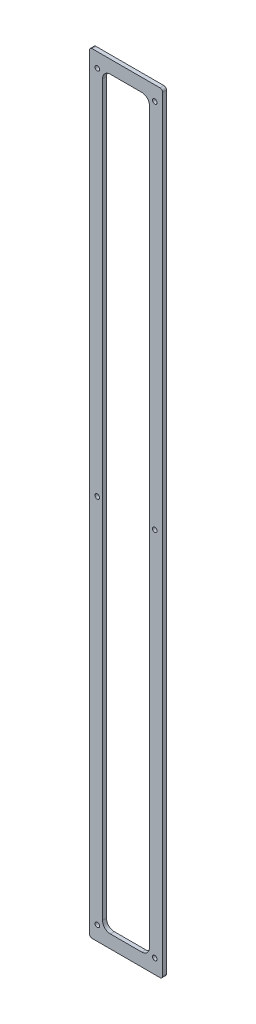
ISO-10303-21;
HEADER;
FILE_DESCRIPTION(('STEP AP214'),'2;1');
FILE_NAME('part.step','',(''),(''),'','','');
FILE_SCHEMA(('AUTOMOTIVE_DESIGN { 1 0 10303 214 1 1 1 1 }'));
ENDSEC;
DATA;
#1=APPLICATION_CONTEXT('core data for automotive mechanical design processes');
#2=APPLICATION_PROTOCOL_DEFINITION('international standard','automotive_design',2000,#1);
#3=PRODUCT_CONTEXT('',#1,'mechanical');
#4=PRODUCT('Part','Part','',(#3));
#5=PRODUCT_RELATED_PRODUCT_CATEGORY('part','',(#4));
#6=PRODUCT_DEFINITION_FORMATION('','',#4);
#7=PRODUCT_DEFINITION_CONTEXT('part definition',#1,'design');
#8=PRODUCT_DEFINITION('design','',#6,#7);
#9=PRODUCT_DEFINITION_SHAPE('','',#8);
#10=(LENGTH_UNIT() NAMED_UNIT(*) SI_UNIT(.MILLI.,.METRE.));
#11=(NAMED_UNIT(*) PLANE_ANGLE_UNIT() SI_UNIT($,.RADIAN.));
#12=(NAMED_UNIT(*) SI_UNIT($,.STERADIAN.) SOLID_ANGLE_UNIT());
#13=UNCERTAINTY_MEASURE_WITH_UNIT(LENGTH_MEASURE(1.E-05),#10,'distance_accuracy_value','');
#14=(GEOMETRIC_REPRESENTATION_CONTEXT(3) GLOBAL_UNCERTAINTY_ASSIGNED_CONTEXT((#13)) GLOBAL_UNIT_ASSIGNED_CONTEXT((#10,
#11,#12)) REPRESENTATION_CONTEXT('',''));
#15=CARTESIAN_POINT('',(0.,0.,0.));
#16=DIRECTION('',(0.,0.,1.));
#17=DIRECTION('',(1.,0.,0.));
#18=AXIS2_PLACEMENT_3D('',#15,#16,#17);
#19=CARTESIAN_POINT('',(-44.4440386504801,468.376,4.7752));
#20=DIRECTION('',(1.,0.,0.));
#21=DIRECTION('',(0.,1.,0.));
#22=AXIS2_PLACEMENT_3D('',#19,#20,#21);
#23=PLANE('',#22);
#24=DIRECTION('',(0.,-1.,0.));
#25=VECTOR('',#24,1.);
#26=CARTESIAN_POINT('',(-44.4440386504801,468.376,0.));
#27=LINE('',#26,#25);
#28=CARTESIAN_POINT('',(-44.4440386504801,465.201,0.));
#29=VERTEX_POINT('',#28);
#30=CARTESIAN_POINT('',(-44.4440386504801,-465.201,0.));
#31=VERTEX_POINT('',#30);
#32=EDGE_CURVE('E179',#29,#31,#27,.T.);
#33=ORIENTED_EDGE('',*,*,#32,.T.);
#34=DIRECTION('',(0.,0.,-1.));
#35=VECTOR('',#34,1.);
#36=CARTESIAN_POINT('',(-44.4440386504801,-465.201,4.7752));
#37=LINE('',#36,#35);
#38=CARTESIAN_POINT('',(-44.4440386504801,-465.201,4.7752));
#39=VERTEX_POINT('',#38);
#40=EDGE_CURVE('E203',#31,#39,#37,.F.);
#41=ORIENTED_EDGE('',*,*,#40,.T.);
#42=DIRECTION('',(0.,-1.,0.));
#43=VECTOR('',#42,1.);
#44=CARTESIAN_POINT('',(-44.4440386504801,468.376,4.7752));
#45=LINE('',#44,#43);
#46=CARTESIAN_POINT('',(-44.4440386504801,465.201,4.7752));
#47=VERTEX_POINT('',#46);
#48=EDGE_CURVE('E177',#47,#39,#45,.T.);
#49=ORIENTED_EDGE('',*,*,#48,.F.);
#50=DIRECTION('',(0.,0.,-1.));
#51=VECTOR('',#50,1.);
#52=CARTESIAN_POINT('',(-44.4440386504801,465.201,4.7752));
#53=LINE('',#52,#51);
#54=EDGE_CURVE('E200',#47,#29,#53,.T.);
#55=ORIENTED_EDGE('',*,*,#54,.T.);
#56=EDGE_LOOP('',(#33,#41,#49,#55));
#57=FACE_BOUND('',#56,.T.);
#58=ADVANCED_FACE('F33',(#57),#23,.F.);
#59=CARTESIAN_POINT('',(-44.4440386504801,-468.376,4.7752));
#60=DIRECTION('',(0.,1.,0.));
#61=DIRECTION('',(0.,0.,1.));
#62=AXIS2_PLACEMENT_3D('',#59,#60,#61);
#63=PLANE('',#62);
#64=DIRECTION('',(1.,0.,0.));
#65=VECTOR('',#64,1.);
#66=CARTESIAN_POINT('',(-44.4440386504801,-468.376,0.));
#67=LINE('',#66,#65);
#68=CARTESIAN_POINT('',(-41.2690386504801,-468.376,0.));
#69=VERTEX_POINT('',#68);
#70=CARTESIAN_POINT('',(41.2809613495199,-468.376,0.));
#71=VERTEX_POINT('',#70);
#72=EDGE_CURVE('E174',#69,#71,#67,.T.);
#73=ORIENTED_EDGE('',*,*,#72,.T.);
#74=DIRECTION('',(0.,0.,-1.));
#75=VECTOR('',#74,1.);
#76=CARTESIAN_POINT('',(41.2809613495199,-468.376,4.7752));
#77=LINE('',#76,#75);
#78=CARTESIAN_POINT('',(41.2809613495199,-468.376,4.7752));
#79=VERTEX_POINT('',#78);
#80=EDGE_CURVE('E152',#71,#79,#77,.F.);
#81=ORIENTED_EDGE('',*,*,#80,.T.);
#82=DIRECTION('',(1.,0.,0.));
#83=VECTOR('',#82,1.);
#84=CARTESIAN_POINT('',(-44.4440386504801,-468.376,4.7752));
#85=LINE('',#84,#83);
#86=CARTESIAN_POINT('',(-41.2690386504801,-468.376,4.7752));
#87=VERTEX_POINT('',#86);
#88=EDGE_CURVE('E281',#87,#79,#85,.T.);
#89=ORIENTED_EDGE('',*,*,#88,.F.);
#90=DIRECTION('',(0.,0.,-1.));
#91=VECTOR('',#90,1.);
#92=CARTESIAN_POINT('',(-41.2690386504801,-468.376,4.7752));
#93=LINE('',#92,#91);
#94=EDGE_CURVE('E157',#87,#69,#93,.T.);
#95=ORIENTED_EDGE('',*,*,#94,.T.);
#96=EDGE_LOOP('',(#73,#81,#89,#95));
#97=FACE_BOUND('',#96,.T.);
#98=ADVANCED_FACE('F298',(#97),#63,.F.);
#99=CARTESIAN_POINT('',(44.4559613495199,468.376,4.7752));
#100=DIRECTION('',(-1.,0.,0.));
#101=DIRECTION('',(0.,0.,1.));
#102=AXIS2_PLACEMENT_3D('',#99,#100,#101);
#103=PLANE('',#102);
#104=DIRECTION('',(0.,1.,0.));
#105=VECTOR('',#104,1.);
#106=CARTESIAN_POINT('',(44.4559613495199,468.376,4.7752));
#107=LINE('',#106,#105);
#108=CARTESIAN_POINT('',(44.4559613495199,-465.201,4.7752));
#109=VERTEX_POINT('',#108);
#110=CARTESIAN_POINT('',(44.4559613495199,465.201,4.7752));
#111=VERTEX_POINT('',#110);
#112=EDGE_CURVE('E167',#109,#111,#107,.T.);
#113=ORIENTED_EDGE('',*,*,#112,.F.);
#114=DIRECTION('',(0.,0.,-1.));
#115=VECTOR('',#114,1.);
#116=CARTESIAN_POINT('',(44.4559613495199,-465.201,4.7752));
#117=LINE('',#116,#115);
#118=CARTESIAN_POINT('',(44.4559613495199,-465.201,0.));
#119=VERTEX_POINT('',#118);
#120=EDGE_CURVE('E151',#109,#119,#117,.T.);
#121=ORIENTED_EDGE('',*,*,#120,.T.);
#122=DIRECTION('',(0.,1.,0.));
#123=VECTOR('',#122,1.);
#124=CARTESIAN_POINT('',(44.4559613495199,468.376,0.));
#125=LINE('',#124,#123);
#126=CARTESIAN_POINT('',(44.4559613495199,465.201,0.));
#127=VERTEX_POINT('',#126);
#128=EDGE_CURVE('E164',#119,#127,#125,.T.);
#129=ORIENTED_EDGE('',*,*,#128,.T.);
#130=DIRECTION('',(0.,0.,-1.));
#131=VECTOR('',#130,1.);
#132=CARTESIAN_POINT('',(44.4559613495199,465.201,4.7752));
#133=LINE('',#132,#131);
#134=EDGE_CURVE('E169',#127,#111,#133,.F.);
#135=ORIENTED_EDGE('',*,*,#134,.T.);
#136=EDGE_LOOP('',(#113,#121,#129,#135));
#137=FACE_BOUND('',#136,.T.);
#138=ADVANCED_FACE('F163',(#137),#103,.F.);
#139=CARTESIAN_POINT('',(-44.4440386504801,468.376,4.7752));
#140=DIRECTION('',(0.,-1.,0.));
#141=DIRECTION('',(0.,0.,-1.));
#142=AXIS2_PLACEMENT_3D('',#139,#140,#141);
#143=PLANE('',#142);
#144=DIRECTION('',(-1.,0.,0.));
#145=VECTOR('',#144,1.);
#146=CARTESIAN_POINT('',(-44.4440386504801,468.376,0.));
#147=LINE('',#146,#145);
#148=CARTESIAN_POINT('',(41.2809613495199,468.376,0.));
#149=VERTEX_POINT('',#148);
#150=CARTESIAN_POINT('',(-41.2690386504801,468.376,0.));
#151=VERTEX_POINT('',#150);
#152=EDGE_CURVE('E173',#149,#151,#147,.T.);
#153=ORIENTED_EDGE('',*,*,#152,.T.);
#154=DIRECTION('',(0.,0.,-1.));
#155=VECTOR('',#154,1.);
#156=CARTESIAN_POINT('',(-41.2690386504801,468.376,4.7752));
#157=LINE('',#156,#155);
#158=CARTESIAN_POINT('',(-41.2690386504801,468.376,4.7752));
#159=VERTEX_POINT('',#158);
#160=EDGE_CURVE('E208',#151,#159,#157,.F.);
#161=ORIENTED_EDGE('',*,*,#160,.T.);
#162=DIRECTION('',(-1.,0.,0.));
#163=VECTOR('',#162,1.);
#164=CARTESIAN_POINT('',(-44.4440386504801,468.376,4.7752));
#165=LINE('',#164,#163);
#166=CARTESIAN_POINT('',(41.2809613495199,468.376,4.7752));
#167=VERTEX_POINT('',#166);
#168=EDGE_CURVE('E183',#167,#159,#165,.T.);
#169=ORIENTED_EDGE('',*,*,#168,.F.);
#170=DIRECTION('',(0.,0.,-1.));
#171=VECTOR('',#170,1.);
#172=CARTESIAN_POINT('',(41.2809613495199,468.376,4.7752));
#173=LINE('',#172,#171);
#174=EDGE_CURVE('E205',#167,#149,#173,.T.);
#175=ORIENTED_EDGE('',*,*,#174,.T.);
#176=EDGE_LOOP('',(#153,#161,#169,#175));
#177=FACE_BOUND('',#176,.T.);
#178=ADVANCED_FACE('F305',(#177),#143,.F.);
#179=CARTESIAN_POINT('',(0.,0.,4.7752));
#180=DIRECTION('',(0.,0.,1.));
#181=DIRECTION('',(1.,0.,0.));
#182=AXIS2_PLACEMENT_3D('',#179,#180,#181);
#183=PLANE('',#182);
#184=CARTESIAN_POINT('',(34.9309613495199,-450.85,4.7752));
#185=DIRECTION('',(0.,0.,1.));
#186=DIRECTION('',(1.,0.,0.));
#187=AXIS2_PLACEMENT_3D('',#184,#185,#186);
#188=CIRCLE('',#187,2.778125);
#189=CARTESIAN_POINT('',(37.7090863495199,-450.85,4.7752));
#190=VERTEX_POINT('',#189);
#191=EDGE_CURVE('E550',#190,#190,#188,.T.);
#192=ORIENTED_EDGE('',*,*,#191,.F.);
#193=EDGE_LOOP('',(#192));
#194=FACE_BOUND('',#193,.T.);
#195=CARTESIAN_POINT('',(-34.9309613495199,-450.85,4.7752));
#196=DIRECTION('',(0.,0.,1.));
#197=DIRECTION('',(1.,0.,0.));
#198=AXIS2_PLACEMENT_3D('',#195,#196,#197);
#199=CIRCLE('',#198,2.778125);
#200=CARTESIAN_POINT('',(-32.1528363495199,-450.85,4.7752));
#201=VERTEX_POINT('',#200);
#202=EDGE_CURVE('E544',#201,#201,#199,.T.);
#203=ORIENTED_EDGE('',*,*,#202,.F.);
#204=EDGE_LOOP('',(#203));
#205=FACE_BOUND('',#204,.T.);
#206=CARTESIAN_POINT('',(34.9309613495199,0.,4.7752));
#207=DIRECTION('',(0.,0.,1.));
#208=DIRECTION('',(1.,0.,0.));
#209=AXIS2_PLACEMENT_3D('',#206,#207,#208);
#210=CIRCLE('',#209,2.778125);
#211=CARTESIAN_POINT('',(37.7090863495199,0.,4.7752));
#212=VERTEX_POINT('',#211);
#213=EDGE_CURVE('E538',#212,#212,#210,.T.);
#214=ORIENTED_EDGE('',*,*,#213,.F.);
#215=EDGE_LOOP('',(#214));
#216=FACE_BOUND('',#215,.T.);
#217=CARTESIAN_POINT('',(-34.9309613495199,0.,4.7752));
#218=DIRECTION('',(0.,0.,1.));
#219=DIRECTION('',(1.,0.,0.));
#220=AXIS2_PLACEMENT_3D('',#217,#218,#219);
#221=CIRCLE('',#220,2.778125);
#222=CARTESIAN_POINT('',(-32.1528363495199,0.,4.7752));
#223=VERTEX_POINT('',#222);
#224=EDGE_CURVE('E523',#223,#223,#221,.T.);
#225=ORIENTED_EDGE('',*,*,#224,.F.);
#226=EDGE_LOOP('',(#225));
#227=FACE_BOUND('',#226,.T.);
#228=CARTESIAN_POINT('',(34.9309613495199,450.85,4.7752));
#229=DIRECTION('',(0.,0.,1.));
#230=DIRECTION('',(1.,0.,0.));
#231=AXIS2_PLACEMENT_3D('',#228,#229,#230);
#232=CIRCLE('',#231,2.778125);
#233=CARTESIAN_POINT('',(37.7090863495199,450.85,4.7752));
#234=VERTEX_POINT('',#233);
#235=EDGE_CURVE('E516',#234,#234,#232,.T.);
#236=ORIENTED_EDGE('',*,*,#235,.F.);
#237=EDGE_LOOP('',(#236));
#238=FACE_BOUND('',#237,.T.);
#239=CARTESIAN_POINT('',(-34.9309613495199,450.85,4.7752));
#240=DIRECTION('',(0.,0.,1.));
#241=DIRECTION('',(1.,0.,0.));
#242=AXIS2_PLACEMENT_3D('',#239,#240,#241);
#243=CIRCLE('',#242,2.778125);
#244=CARTESIAN_POINT('',(-32.1528363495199,450.85,4.7752));
#245=VERTEX_POINT('',#244);
#246=EDGE_CURVE('E520',#245,#245,#243,.T.);
#247=ORIENTED_EDGE('',*,*,#246,.F.);
#248=EDGE_LOOP('',(#247));
#249=FACE_BOUND('',#248,.T.);
#250=DIRECTION('',(0.,-1.,0.));
#251=VECTOR('',#250,1.);
#252=CARTESIAN_POINT('',(-28.575,452.501,4.7752));
#253=LINE('',#252,#251);
#254=CARTESIAN_POINT('',(-28.575,442.976,4.7752));
#255=VERTEX_POINT('',#254);
#256=CARTESIAN_POINT('',(-28.5749999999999,-442.976,4.7752));
#257=VERTEX_POINT('',#256);
#258=EDGE_CURVE('E246',#255,#257,#253,.T.);
#259=ORIENTED_EDGE('',*,*,#258,.F.);
#260=CARTESIAN_POINT('',(-19.05,442.976,4.7752));
#261=DIRECTION('',(0.,0.,1.));
#262=DIRECTION('',(1.,0.,0.));
#263=AXIS2_PLACEMENT_3D('',#260,#261,#262);
#264=CIRCLE('',#263,9.525);
#265=CARTESIAN_POINT('',(-19.05,452.501,4.7752));
#266=VERTEX_POINT('',#265);
#267=EDGE_CURVE('E41',#255,#266,#264,.F.);
#268=ORIENTED_EDGE('',*,*,#267,.T.);
#269=DIRECTION('',(-1.,0.,0.));
#270=VECTOR('',#269,1.);
#271=CARTESIAN_POINT('',(-28.575,452.501,4.7752));
#272=LINE('',#271,#270);
#273=CARTESIAN_POINT('',(19.05,452.501,4.7752));
#274=VERTEX_POINT('',#273);
#275=EDGE_CURVE('E244',#274,#266,#272,.T.);
#276=ORIENTED_EDGE('',*,*,#275,.F.);
#277=CARTESIAN_POINT('',(19.05,442.976,4.7752));
#278=DIRECTION('',(0.,0.,1.));
#279=DIRECTION('',(1.,0.,0.));
#280=AXIS2_PLACEMENT_3D('',#277,#278,#279);
#281=CIRCLE('',#280,9.525);
#282=CARTESIAN_POINT('',(28.575,442.976,4.7752));
#283=VERTEX_POINT('',#282);
#284=EDGE_CURVE('E237',#274,#283,#281,.F.);
#285=ORIENTED_EDGE('',*,*,#284,.T.);
#286=DIRECTION('',(0.,1.,0.));
#287=VECTOR('',#286,1.);
#288=CARTESIAN_POINT('',(28.575,452.501,4.7752));
#289=LINE('',#288,#287);
#290=CARTESIAN_POINT('',(28.575,-442.976,4.7752));
#291=VERTEX_POINT('',#290);
#292=EDGE_CURVE('E252',#291,#283,#289,.T.);
#293=ORIENTED_EDGE('',*,*,#292,.F.);
#294=CARTESIAN_POINT('',(19.05,-442.976,4.7752));
#295=DIRECTION('',(0.,0.,1.));
#296=DIRECTION('',(1.,0.,0.));
#297=AXIS2_PLACEMENT_3D('',#294,#295,#296);
#298=CIRCLE('',#297,9.525);
#299=CARTESIAN_POINT('',(19.05,-452.501,4.7752));
#300=VERTEX_POINT('',#299);
#301=EDGE_CURVE('E229',#291,#300,#298,.F.);
#302=ORIENTED_EDGE('',*,*,#301,.T.);
#303=DIRECTION('',(1.,0.,0.));
#304=VECTOR('',#303,1.);
#305=CARTESIAN_POINT('',(-28.5749999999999,-452.501,4.7752));
#306=LINE('',#305,#304);
#307=CARTESIAN_POINT('',(-19.0499999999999,-452.501,4.7752));
#308=VERTEX_POINT('',#307);
#309=EDGE_CURVE('E274',#308,#300,#306,.T.);
#310=ORIENTED_EDGE('',*,*,#309,.F.);
#311=CARTESIAN_POINT('',(-19.0499999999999,-442.976,4.7752));
#312=DIRECTION('',(0.,0.,1.));
#313=DIRECTION('',(1.,0.,0.));
#314=AXIS2_PLACEMENT_3D('',#311,#312,#313);
#315=CIRCLE('',#314,9.525);
#316=EDGE_CURVE('E233',#308,#257,#315,.F.);
#317=ORIENTED_EDGE('',*,*,#316,.T.);
#318=EDGE_LOOP('',(#259,#268,#276,#285,#293,#302,#310,#317));
#319=FACE_BOUND('',#318,.T.);
#320=ORIENTED_EDGE('',*,*,#88,.T.);
#321=CARTESIAN_POINT('',(41.2809613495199,-465.201,4.7752));
#322=DIRECTION('',(0.,0.,1.));
#323=DIRECTION('',(1.,0.,0.));
#324=AXIS2_PLACEMENT_3D('',#321,#322,#323);
#325=CIRCLE('',#324,3.175);
#326=EDGE_CURVE('E198',#79,#109,#325,.T.);
#327=ORIENTED_EDGE('',*,*,#326,.T.);
#328=ORIENTED_EDGE('',*,*,#112,.T.);
#329=CARTESIAN_POINT('',(41.2809613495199,465.201,4.7752));
#330=DIRECTION('',(0.,0.,1.));
#331=DIRECTION('',(1.,0.,0.));
#332=AXIS2_PLACEMENT_3D('',#329,#330,#331);
#333=CIRCLE('',#332,3.175);
#334=EDGE_CURVE('E192',#111,#167,#333,.T.);
#335=ORIENTED_EDGE('',*,*,#334,.T.);
#336=ORIENTED_EDGE('',*,*,#168,.T.);
#337=CARTESIAN_POINT('',(-41.2690386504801,465.201,4.7752));
#338=DIRECTION('',(0.,0.,1.));
#339=DIRECTION('',(1.,0.,0.));
#340=AXIS2_PLACEMENT_3D('',#337,#338,#339);
#341=CIRCLE('',#340,3.175);
#342=EDGE_CURVE('E194',#159,#47,#341,.T.);
#343=ORIENTED_EDGE('',*,*,#342,.T.);
#344=ORIENTED_EDGE('',*,*,#48,.T.);
#345=CARTESIAN_POINT('',(-41.2690386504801,-465.201,4.7752));
#346=DIRECTION('',(0.,0.,1.));
#347=DIRECTION('',(1.,0.,0.));
#348=AXIS2_PLACEMENT_3D('',#345,#346,#347);
#349=CIRCLE('',#348,3.175);
#350=EDGE_CURVE('E196',#39,#87,#349,.T.);
#351=ORIENTED_EDGE('',*,*,#350,.T.);
#352=EDGE_LOOP('',(#320,#327,#328,#335,#336,#343,#344,#351));
#353=FACE_BOUND('',#352,.T.);
#354=ADVANCED_FACE('F242',(#194,#205,#216,#227,#238,#249,#319,#353),#183,.T.);
#355=CARTESIAN_POINT('',(0.,0.,0.));
#356=DIRECTION('',(0.,0.,1.));
#357=DIRECTION('',(1.,0.,0.));
#358=AXIS2_PLACEMENT_3D('',#355,#356,#357);
#359=PLANE('',#358);
#360=CARTESIAN_POINT('',(34.9309613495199,-450.85,0.));
#361=DIRECTION('',(0.,0.,1.));
#362=DIRECTION('',(1.,0.,0.));
#363=AXIS2_PLACEMENT_3D('',#360,#361,#362);
#364=CIRCLE('',#363,2.778125);
#365=CARTESIAN_POINT('',(37.7090863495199,-450.85,0.));
#366=VERTEX_POINT('',#365);
#367=EDGE_CURVE('E547',#366,#366,#364,.T.);
#368=ORIENTED_EDGE('',*,*,#367,.T.);
#369=EDGE_LOOP('',(#368));
#370=FACE_BOUND('',#369,.T.);
#371=CARTESIAN_POINT('',(-34.9309613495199,-450.85,0.));
#372=DIRECTION('',(0.,0.,1.));
#373=DIRECTION('',(1.,0.,0.));
#374=AXIS2_PLACEMENT_3D('',#371,#372,#373);
#375=CIRCLE('',#374,2.778125);
#376=CARTESIAN_POINT('',(-32.1528363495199,-450.85,0.));
#377=VERTEX_POINT('',#376);
#378=EDGE_CURVE('E541',#377,#377,#375,.T.);
#379=ORIENTED_EDGE('',*,*,#378,.T.);
#380=EDGE_LOOP('',(#379));
#381=FACE_BOUND('',#380,.T.);
#382=CARTESIAN_POINT('',(34.9309613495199,0.,0.));
#383=DIRECTION('',(0.,0.,1.));
#384=DIRECTION('',(1.,0.,0.));
#385=AXIS2_PLACEMENT_3D('',#382,#383,#384);
#386=CIRCLE('',#385,2.778125);
#387=CARTESIAN_POINT('',(37.7090863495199,0.,0.));
#388=VERTEX_POINT('',#387);
#389=EDGE_CURVE('E535',#388,#388,#386,.T.);
#390=ORIENTED_EDGE('',*,*,#389,.T.);
#391=EDGE_LOOP('',(#390));
#392=FACE_BOUND('',#391,.T.);
#393=CARTESIAN_POINT('',(-34.9309613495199,0.,0.));
#394=DIRECTION('',(0.,0.,1.));
#395=DIRECTION('',(1.,0.,0.));
#396=AXIS2_PLACEMENT_3D('',#393,#394,#395);
#397=CIRCLE('',#396,2.778125);
#398=CARTESIAN_POINT('',(-32.1528363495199,0.,0.));
#399=VERTEX_POINT('',#398);
#400=EDGE_CURVE('E518',#399,#399,#397,.T.);
#401=ORIENTED_EDGE('',*,*,#400,.T.);
#402=EDGE_LOOP('',(#401));
#403=FACE_BOUND('',#402,.T.);
#404=CARTESIAN_POINT('',(34.9309613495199,450.85,0.));
#405=DIRECTION('',(0.,0.,1.));
#406=DIRECTION('',(1.,0.,0.));
#407=AXIS2_PLACEMENT_3D('',#404,#405,#406);
#408=CIRCLE('',#407,2.778125);
#409=CARTESIAN_POINT('',(37.7090863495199,450.85,0.));
#410=VERTEX_POINT('',#409);
#411=EDGE_CURVE('E513',#410,#410,#408,.T.);
#412=ORIENTED_EDGE('',*,*,#411,.T.);
#413=EDGE_LOOP('',(#412));
#414=FACE_BOUND('',#413,.T.);
#415=CARTESIAN_POINT('',(-34.9309613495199,450.85,0.));
#416=DIRECTION('',(0.,0.,1.));
#417=DIRECTION('',(1.,0.,0.));
#418=AXIS2_PLACEMENT_3D('',#415,#416,#417);
#419=CIRCLE('',#418,2.778125);
#420=CARTESIAN_POINT('',(-32.1528363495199,450.85,0.));
#421=VERTEX_POINT('',#420);
#422=EDGE_CURVE('E268',#421,#421,#419,.T.);
#423=ORIENTED_EDGE('',*,*,#422,.T.);
#424=EDGE_LOOP('',(#423));
#425=FACE_BOUND('',#424,.T.);
#426=DIRECTION('',(0.,1.,0.));
#427=VECTOR('',#426,1.);
#428=CARTESIAN_POINT('',(28.575,452.501,0.));
#429=LINE('',#428,#427);
#430=CARTESIAN_POINT('',(28.575,-442.976,0.));
#431=VERTEX_POINT('',#430);
#432=CARTESIAN_POINT('',(28.575,442.976,0.));
#433=VERTEX_POINT('',#432);
#434=EDGE_CURVE('E265',#431,#433,#429,.T.);
#435=ORIENTED_EDGE('',*,*,#434,.T.);
#436=CARTESIAN_POINT('',(19.05,442.976,0.));
#437=DIRECTION('',(0.,0.,1.));
#438=DIRECTION('',(1.,0.,0.));
#439=AXIS2_PLACEMENT_3D('',#436,#437,#438);
#440=CIRCLE('',#439,9.525);
#441=CARTESIAN_POINT('',(19.05,452.501,0.));
#442=VERTEX_POINT('',#441);
#443=EDGE_CURVE('E55',#433,#442,#440,.T.);
#444=ORIENTED_EDGE('',*,*,#443,.T.);
#445=DIRECTION('',(-1.,0.,0.));
#446=VECTOR('',#445,1.);
#447=CARTESIAN_POINT('',(-28.575,452.501,0.));
#448=LINE('',#447,#446);
#449=CARTESIAN_POINT('',(-19.05,452.501,0.));
#450=VERTEX_POINT('',#449);
#451=EDGE_CURVE('E258',#442,#450,#448,.T.);
#452=ORIENTED_EDGE('',*,*,#451,.T.);
#453=CARTESIAN_POINT('',(-19.05,442.976,0.));
#454=DIRECTION('',(0.,0.,1.));
#455=DIRECTION('',(1.,0.,0.));
#456=AXIS2_PLACEMENT_3D('',#453,#454,#455);
#457=CIRCLE('',#456,9.525);
#458=CARTESIAN_POINT('',(-28.575,442.976,0.));
#459=VERTEX_POINT('',#458);
#460=EDGE_CURVE('E11',#450,#459,#457,.T.);
#461=ORIENTED_EDGE('',*,*,#460,.T.);
#462=DIRECTION('',(0.,-1.,0.));
#463=VECTOR('',#462,1.);
#464=CARTESIAN_POINT('',(-28.575,452.501,0.));
#465=LINE('',#464,#463);
#466=CARTESIAN_POINT('',(-28.5749999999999,-442.976,0.));
#467=VERTEX_POINT('',#466);
#468=EDGE_CURVE('E251',#459,#467,#465,.T.);
#469=ORIENTED_EDGE('',*,*,#468,.T.);
#470=CARTESIAN_POINT('',(-19.0499999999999,-442.976,0.));
#471=DIRECTION('',(0.,0.,1.));
#472=DIRECTION('',(1.,0.,0.));
#473=AXIS2_PLACEMENT_3D('',#470,#471,#472);
#474=CIRCLE('',#473,9.525);
#475=CARTESIAN_POINT('',(-19.0499999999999,-452.501,0.));
#476=VERTEX_POINT('',#475);
#477=EDGE_CURVE('E235',#467,#476,#474,.T.);
#478=ORIENTED_EDGE('',*,*,#477,.T.);
#479=DIRECTION('',(1.,0.,0.));
#480=VECTOR('',#479,1.);
#481=CARTESIAN_POINT('',(-28.5749999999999,-452.501,0.));
#482=LINE('',#481,#480);
#483=CARTESIAN_POINT('',(19.05,-452.501,0.));
#484=VERTEX_POINT('',#483);
#485=EDGE_CURVE('E262',#476,#484,#482,.T.);
#486=ORIENTED_EDGE('',*,*,#485,.T.);
#487=CARTESIAN_POINT('',(19.05,-442.976,0.));
#488=DIRECTION('',(0.,0.,1.));
#489=DIRECTION('',(1.,0.,0.));
#490=AXIS2_PLACEMENT_3D('',#487,#488,#489);
#491=CIRCLE('',#490,9.525);
#492=EDGE_CURVE('E231',#484,#431,#491,.T.);
#493=ORIENTED_EDGE('',*,*,#492,.T.);
#494=EDGE_LOOP('',(#435,#444,#452,#461,#469,#478,#486,#493));
#495=FACE_BOUND('',#494,.T.);
#496=ORIENTED_EDGE('',*,*,#128,.F.);
#497=CARTESIAN_POINT('',(41.2809613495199,-465.201,0.));
#498=DIRECTION('',(0.,0.,1.));
#499=DIRECTION('',(1.,0.,0.));
#500=AXIS2_PLACEMENT_3D('',#497,#498,#499);
#501=CIRCLE('',#500,3.175);
#502=EDGE_CURVE('E147',#119,#71,#501,.F.);
#503=ORIENTED_EDGE('',*,*,#502,.T.);
#504=ORIENTED_EDGE('',*,*,#72,.F.);
#505=CARTESIAN_POINT('',(-41.2690386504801,-465.201,0.));
#506=DIRECTION('',(0.,0.,1.));
#507=DIRECTION('',(1.,0.,0.));
#508=AXIS2_PLACEMENT_3D('',#505,#506,#507);
#509=CIRCLE('',#508,3.175);
#510=EDGE_CURVE('E158',#69,#31,#509,.F.);
#511=ORIENTED_EDGE('',*,*,#510,.T.);
#512=ORIENTED_EDGE('',*,*,#32,.F.);
#513=CARTESIAN_POINT('',(-41.2690386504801,465.201,0.));
#514=DIRECTION('',(0.,0.,1.));
#515=DIRECTION('',(1.,0.,0.));
#516=AXIS2_PLACEMENT_3D('',#513,#514,#515);
#517=CIRCLE('',#516,3.175);
#518=EDGE_CURVE('E186',#29,#151,#517,.F.);
#519=ORIENTED_EDGE('',*,*,#518,.T.);
#520=ORIENTED_EDGE('',*,*,#152,.F.);
#521=CARTESIAN_POINT('',(41.2809613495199,465.201,0.));
#522=DIRECTION('',(0.,0.,1.));
#523=DIRECTION('',(1.,0.,0.));
#524=AXIS2_PLACEMENT_3D('',#521,#522,#523);
#525=CIRCLE('',#524,3.175);
#526=EDGE_CURVE('E168',#149,#127,#525,.F.);
#527=ORIENTED_EDGE('',*,*,#526,.T.);
#528=EDGE_LOOP('',(#496,#503,#504,#511,#512,#519,#520,#527));
#529=FACE_BOUND('',#528,.T.);
#530=ADVANCED_FACE('F171',(#370,#381,#392,#403,#414,#425,#495,#529),#359,.F.);
#531=CARTESIAN_POINT('',(-28.575,452.501,0.));
#532=DIRECTION('',(-1.,0.,0.));
#533=DIRECTION('',(0.,-1.,0.));
#534=AXIS2_PLACEMENT_3D('',#531,#532,#533);
#535=PLANE('',#534);
#536=ORIENTED_EDGE('',*,*,#258,.T.);
#537=DIRECTION('',(0.,0.,1.));
#538=VECTOR('',#537,1.);
#539=CARTESIAN_POINT('',(-28.5749999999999,-442.976,0.));
#540=LINE('',#539,#538);
#541=EDGE_CURVE('E223',#257,#467,#540,.F.);
#542=ORIENTED_EDGE('',*,*,#541,.T.);
#543=ORIENTED_EDGE('',*,*,#468,.F.);
#544=DIRECTION('',(0.,0.,1.));
#545=VECTOR('',#544,1.);
#546=CARTESIAN_POINT('',(-28.575,442.976,4.7752));
#547=LINE('',#546,#545);
#548=EDGE_CURVE('E220',#459,#255,#547,.T.);
#549=ORIENTED_EDGE('',*,*,#548,.T.);
#550=EDGE_LOOP('',(#536,#542,#543,#549));
#551=FACE_BOUND('',#550,.T.);
#552=ADVANCED_FACE('F260',(#551),#535,.F.);
#553=CARTESIAN_POINT('',(-28.575,452.501,0.));
#554=DIRECTION('',(0.,1.,0.));
#555=DIRECTION('',(0.,0.,1.));
#556=AXIS2_PLACEMENT_3D('',#553,#554,#555);
#557=PLANE('',#556);
#558=ORIENTED_EDGE('',*,*,#451,.F.);
#559=DIRECTION('',(0.,0.,1.));
#560=VECTOR('',#559,1.);
#561=CARTESIAN_POINT('',(19.05,452.501,4.7752));
#562=LINE('',#561,#560);
#563=EDGE_CURVE('E226',#442,#274,#562,.T.);
#564=ORIENTED_EDGE('',*,*,#563,.T.);
#565=ORIENTED_EDGE('',*,*,#275,.T.);
#566=DIRECTION('',(0.,0.,1.));
#567=VECTOR('',#566,1.);
#568=CARTESIAN_POINT('',(-19.05,452.501,0.));
#569=LINE('',#568,#567);
#570=EDGE_CURVE('E48',#266,#450,#569,.F.);
#571=ORIENTED_EDGE('',*,*,#570,.T.);
#572=EDGE_LOOP('',(#558,#564,#565,#571));
#573=FACE_BOUND('',#572,.T.);
#574=ADVANCED_FACE('F249',(#573),#557,.F.);
#575=CARTESIAN_POINT('',(28.575,452.501,0.));
#576=DIRECTION('',(1.,0.,0.));
#577=DIRECTION('',(0.,0.,-1.));
#578=AXIS2_PLACEMENT_3D('',#575,#576,#577);
#579=PLANE('',#578);
#580=ORIENTED_EDGE('',*,*,#434,.F.);
#581=DIRECTION('',(0.,0.,1.));
#582=VECTOR('',#581,1.);
#583=CARTESIAN_POINT('',(28.575,-442.976,4.7752));
#584=LINE('',#583,#582);
#585=EDGE_CURVE('E212',#431,#291,#584,.T.);
#586=ORIENTED_EDGE('',*,*,#585,.T.);
#587=ORIENTED_EDGE('',*,*,#292,.T.);
#588=DIRECTION('',(0.,0.,1.));
#589=VECTOR('',#588,1.);
#590=CARTESIAN_POINT('',(28.575,442.976,0.));
#591=LINE('',#590,#589);
#592=EDGE_CURVE('E210',#283,#433,#591,.F.);
#593=ORIENTED_EDGE('',*,*,#592,.T.);
#594=EDGE_LOOP('',(#580,#586,#587,#593));
#595=FACE_BOUND('',#594,.T.);
#596=ADVANCED_FACE('F340',(#595),#579,.F.);
#597=CARTESIAN_POINT('',(-28.5749999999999,-452.501,0.));
#598=DIRECTION('',(0.,-1.,0.));
#599=DIRECTION('',(0.,0.,-1.));
#600=AXIS2_PLACEMENT_3D('',#597,#598,#599);
#601=PLANE('',#600);
#602=ORIENTED_EDGE('',*,*,#309,.T.);
#603=DIRECTION('',(0.,0.,1.));
#604=VECTOR('',#603,1.);
#605=CARTESIAN_POINT('',(19.05,-452.501,0.));
#606=LINE('',#605,#604);
#607=EDGE_CURVE('E218',#300,#484,#606,.F.);
#608=ORIENTED_EDGE('',*,*,#607,.T.);
#609=ORIENTED_EDGE('',*,*,#485,.F.);
#610=DIRECTION('',(0.,0.,1.));
#611=VECTOR('',#610,1.);
#612=CARTESIAN_POINT('',(-19.0499999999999,-452.501,4.7752));
#613=LINE('',#612,#611);
#614=EDGE_CURVE('E215',#476,#308,#613,.T.);
#615=ORIENTED_EDGE('',*,*,#614,.T.);
#616=EDGE_LOOP('',(#602,#608,#609,#615));
#617=FACE_BOUND('',#616,.T.);
#618=ADVANCED_FACE('F346',(#617),#601,.F.);
#619=CARTESIAN_POINT('',(-34.9309613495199,450.85,4.7752));
#620=DIRECTION('',(0.,0.,1.));
#621=DIRECTION('',(1.,0.,0.));
#622=AXIS2_PLACEMENT_3D('',#619,#620,#621);
#623=CYLINDRICAL_SURFACE('',#622,2.778125);
#624=ORIENTED_EDGE('',*,*,#422,.F.);
#625=EDGE_LOOP('',(#624));
#626=FACE_BOUND('',#625,.T.);
#627=ORIENTED_EDGE('',*,*,#246,.T.);
#628=EDGE_LOOP('',(#627));
#629=FACE_BOUND('',#628,.T.);
#630=ADVANCED_FACE('F350',(#626,#629),#623,.F.);
#631=CARTESIAN_POINT('',(34.9309613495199,450.85,4.7752));
#632=DIRECTION('',(0.,0.,1.));
#633=DIRECTION('',(1.,0.,0.));
#634=AXIS2_PLACEMENT_3D('',#631,#632,#633);
#635=CYLINDRICAL_SURFACE('',#634,2.778125);
#636=ORIENTED_EDGE('',*,*,#411,.F.);
#637=EDGE_LOOP('',(#636));
#638=FACE_BOUND('',#637,.T.);
#639=ORIENTED_EDGE('',*,*,#235,.T.);
#640=EDGE_LOOP('',(#639));
#641=FACE_BOUND('',#640,.T.);
#642=ADVANCED_FACE('F356',(#638,#641),#635,.F.);
#643=CARTESIAN_POINT('',(-34.9309613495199,0.,4.7752));
#644=DIRECTION('',(0.,0.,1.));
#645=DIRECTION('',(1.,0.,0.));
#646=AXIS2_PLACEMENT_3D('',#643,#644,#645);
#647=CYLINDRICAL_SURFACE('',#646,2.778125);
#648=ORIENTED_EDGE('',*,*,#400,.F.);
#649=EDGE_LOOP('',(#648));
#650=FACE_BOUND('',#649,.T.);
#651=ORIENTED_EDGE('',*,*,#224,.T.);
#652=EDGE_LOOP('',(#651));
#653=FACE_BOUND('',#652,.T.);
#654=ADVANCED_FACE('F469',(#650,#653),#647,.F.);
#655=CARTESIAN_POINT('',(34.9309613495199,0.,4.7752));
#656=DIRECTION('',(0.,0.,1.));
#657=DIRECTION('',(1.,0.,0.));
#658=AXIS2_PLACEMENT_3D('',#655,#656,#657);
#659=CYLINDRICAL_SURFACE('',#658,2.778125);
#660=ORIENTED_EDGE('',*,*,#389,.F.);
#661=EDGE_LOOP('',(#660));
#662=FACE_BOUND('',#661,.T.);
#663=ORIENTED_EDGE('',*,*,#213,.T.);
#664=EDGE_LOOP('',(#663));
#665=FACE_BOUND('',#664,.T.);
#666=ADVANCED_FACE('F461',(#662,#665),#659,.F.);
#667=CARTESIAN_POINT('',(-34.9309613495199,-450.85,4.7752));
#668=DIRECTION('',(0.,0.,1.));
#669=DIRECTION('',(1.,0.,0.));
#670=AXIS2_PLACEMENT_3D('',#667,#668,#669);
#671=CYLINDRICAL_SURFACE('',#670,2.778125);
#672=ORIENTED_EDGE('',*,*,#378,.F.);
#673=EDGE_LOOP('',(#672));
#674=FACE_BOUND('',#673,.T.);
#675=ORIENTED_EDGE('',*,*,#202,.T.);
#676=EDGE_LOOP('',(#675));
#677=FACE_BOUND('',#676,.T.);
#678=ADVANCED_FACE('F452',(#674,#677),#671,.F.);
#679=CARTESIAN_POINT('',(34.9309613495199,-450.85,4.7752));
#680=DIRECTION('',(0.,0.,1.));
#681=DIRECTION('',(1.,0.,0.));
#682=AXIS2_PLACEMENT_3D('',#679,#680,#681);
#683=CYLINDRICAL_SURFACE('',#682,2.778125);
#684=ORIENTED_EDGE('',*,*,#367,.F.);
#685=EDGE_LOOP('',(#684));
#686=FACE_BOUND('',#685,.T.);
#687=ORIENTED_EDGE('',*,*,#191,.T.);
#688=EDGE_LOOP('',(#687));
#689=FACE_BOUND('',#688,.T.);
#690=ADVANCED_FACE('F312',(#686,#689),#683,.F.);
#691=CARTESIAN_POINT('',(41.2809613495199,-465.201,4.7752));
#692=DIRECTION('',(0.,0.,-1.));
#693=DIRECTION('',(-1.,0.,0.));
#694=AXIS2_PLACEMENT_3D('',#691,#692,#693);
#695=CYLINDRICAL_SURFACE('',#694,3.175);
#696=ORIENTED_EDGE('',*,*,#326,.F.);
#697=ORIENTED_EDGE('',*,*,#80,.F.);
#698=ORIENTED_EDGE('',*,*,#502,.F.);
#699=ORIENTED_EDGE('',*,*,#120,.F.);
#700=EDGE_LOOP('',(#696,#697,#698,#699));
#701=FACE_BOUND('',#700,.T.);
#702=ADVANCED_FACE('F150',(#701),#695,.T.);
#703=CARTESIAN_POINT('',(-41.2690386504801,-465.201,4.7752));
#704=DIRECTION('',(0.,0.,-1.));
#705=DIRECTION('',(-1.,0.,0.));
#706=AXIS2_PLACEMENT_3D('',#703,#704,#705);
#707=CYLINDRICAL_SURFACE('',#706,3.175);
#708=ORIENTED_EDGE('',*,*,#350,.F.);
#709=ORIENTED_EDGE('',*,*,#40,.F.);
#710=ORIENTED_EDGE('',*,*,#510,.F.);
#711=ORIENTED_EDGE('',*,*,#94,.F.);
#712=EDGE_LOOP('',(#708,#709,#710,#711));
#713=FACE_BOUND('',#712,.T.);
#714=ADVANCED_FACE('F294',(#713),#707,.T.);
#715=CARTESIAN_POINT('',(-41.2690386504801,465.201,4.7752));
#716=DIRECTION('',(0.,0.,-1.));
#717=DIRECTION('',(-1.,0.,0.));
#718=AXIS2_PLACEMENT_3D('',#715,#716,#717);
#719=CYLINDRICAL_SURFACE('',#718,3.175);
#720=ORIENTED_EDGE('',*,*,#342,.F.);
#721=ORIENTED_EDGE('',*,*,#160,.F.);
#722=ORIENTED_EDGE('',*,*,#518,.F.);
#723=ORIENTED_EDGE('',*,*,#54,.F.);
#724=EDGE_LOOP('',(#720,#721,#722,#723));
#725=FACE_BOUND('',#724,.T.);
#726=ADVANCED_FACE('F315',(#725),#719,.T.);
#727=CARTESIAN_POINT('',(41.2809613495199,465.201,4.7752));
#728=DIRECTION('',(0.,0.,-1.));
#729=DIRECTION('',(-1.,0.,0.));
#730=AXIS2_PLACEMENT_3D('',#727,#728,#729);
#731=CYLINDRICAL_SURFACE('',#730,3.175);
#732=ORIENTED_EDGE('',*,*,#334,.F.);
#733=ORIENTED_EDGE('',*,*,#134,.F.);
#734=ORIENTED_EDGE('',*,*,#526,.F.);
#735=ORIENTED_EDGE('',*,*,#174,.F.);
#736=EDGE_LOOP('',(#732,#733,#734,#735));
#737=FACE_BOUND('',#736,.T.);
#738=ADVANCED_FACE('F318',(#737),#731,.T.);
#739=CARTESIAN_POINT('',(19.05,-442.976,0.));
#740=DIRECTION('',(0.,0.,-1.));
#741=DIRECTION('',(-1.,0.,0.));
#742=AXIS2_PLACEMENT_3D('',#739,#740,#741);
#743=CYLINDRICAL_SURFACE('',#742,9.525);
#744=ORIENTED_EDGE('',*,*,#492,.F.);
#745=ORIENTED_EDGE('',*,*,#607,.F.);
#746=ORIENTED_EDGE('',*,*,#301,.F.);
#747=ORIENTED_EDGE('',*,*,#585,.F.);
#748=EDGE_LOOP('',(#744,#745,#746,#747));
#749=FACE_BOUND('',#748,.T.);
#750=ADVANCED_FACE('F322',(#749),#743,.F.);
#751=CARTESIAN_POINT('',(-19.0499999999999,-442.976,0.));
#752=DIRECTION('',(0.,0.,-1.));
#753=DIRECTION('',(-1.,0.,0.));
#754=AXIS2_PLACEMENT_3D('',#751,#752,#753);
#755=CYLINDRICAL_SURFACE('',#754,9.525);
#756=ORIENTED_EDGE('',*,*,#477,.F.);
#757=ORIENTED_EDGE('',*,*,#541,.F.);
#758=ORIENTED_EDGE('',*,*,#316,.F.);
#759=ORIENTED_EDGE('',*,*,#614,.F.);
#760=EDGE_LOOP('',(#756,#757,#758,#759));
#761=FACE_BOUND('',#760,.T.);
#762=ADVANCED_FACE('F326',(#761),#755,.F.);
#763=CARTESIAN_POINT('',(19.05,442.976,0.));
#764=DIRECTION('',(0.,0.,-1.));
#765=DIRECTION('',(-1.,0.,0.));
#766=AXIS2_PLACEMENT_3D('',#763,#764,#765);
#767=CYLINDRICAL_SURFACE('',#766,9.525);
#768=ORIENTED_EDGE('',*,*,#443,.F.);
#769=ORIENTED_EDGE('',*,*,#592,.F.);
#770=ORIENTED_EDGE('',*,*,#284,.F.);
#771=ORIENTED_EDGE('',*,*,#563,.F.);
#772=EDGE_LOOP('',(#768,#769,#770,#771));
#773=FACE_BOUND('',#772,.T.);
#774=ADVANCED_FACE('F329',(#773),#767,.F.);
#775=CARTESIAN_POINT('',(-19.05,442.976,0.));
#776=DIRECTION('',(0.,0.,-1.));
#777=DIRECTION('',(-1.,0.,0.));
#778=AXIS2_PLACEMENT_3D('',#775,#776,#777);
#779=CYLINDRICAL_SURFACE('',#778,9.525);
#780=ORIENTED_EDGE('',*,*,#460,.F.);
#781=ORIENTED_EDGE('',*,*,#570,.F.);
#782=ORIENTED_EDGE('',*,*,#267,.F.);
#783=ORIENTED_EDGE('',*,*,#548,.F.);
#784=EDGE_LOOP('',(#780,#781,#782,#783));
#785=FACE_BOUND('',#784,.T.);
#786=ADVANCED_FACE('F35',(#785),#779,.F.);
#787=CLOSED_SHELL('',(#58,#98,#138,#178,#354,#530,#552,#574,#596,#618,#630,#642,#654,#666,#678,
#690,#702,#714,#726,#738,#750,#762,#774,#786));
#788=MANIFOLD_SOLID_BREP('B2',#787);
#789=ADVANCED_BREP_SHAPE_REPRESENTATION('',(#18,#788),#14);
#790=SHAPE_DEFINITION_REPRESENTATION(#9,#789);
ENDSEC;
END-ISO-10303-21;
